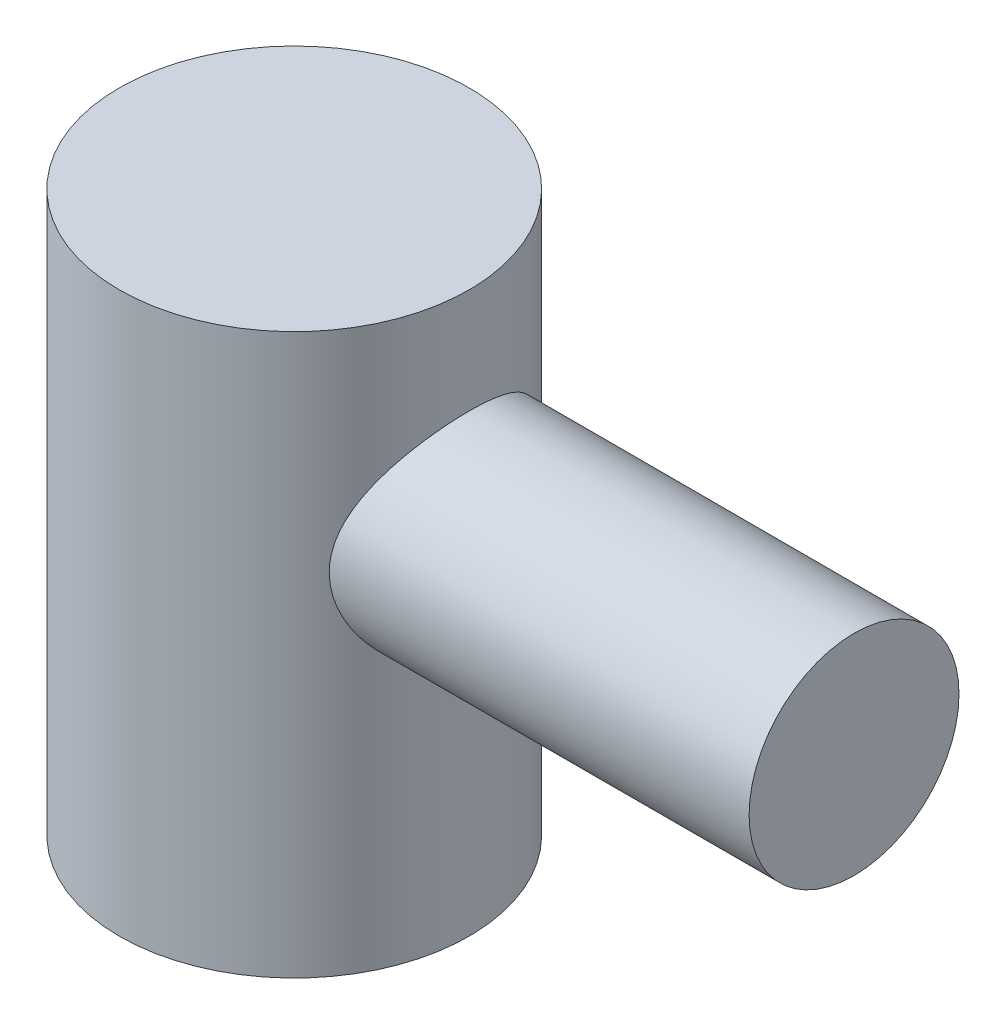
ISO-10303-21;
HEADER;
FILE_DESCRIPTION(('STEP AP214'),'2;1');
FILE_NAME('part.step','',(''),(''),'','','');
FILE_SCHEMA(('AUTOMOTIVE_DESIGN { 1 0 10303 214 1 1 1 1 }'));
ENDSEC;
DATA;
#1=APPLICATION_CONTEXT('core data for automotive mechanical design processes');
#2=APPLICATION_PROTOCOL_DEFINITION('international standard','automotive_design',2000,#1);
#3=PRODUCT_CONTEXT('',#1,'mechanical');
#4=PRODUCT('Part','Part','',(#3));
#5=PRODUCT_RELATED_PRODUCT_CATEGORY('part','',(#4));
#6=PRODUCT_DEFINITION_FORMATION('','',#4);
#7=PRODUCT_DEFINITION_CONTEXT('part definition',#1,'design');
#8=PRODUCT_DEFINITION('design','',#6,#7);
#9=PRODUCT_DEFINITION_SHAPE('','',#8);
#10=(LENGTH_UNIT() NAMED_UNIT(*) SI_UNIT(.MILLI.,.METRE.));
#11=(NAMED_UNIT(*) PLANE_ANGLE_UNIT() SI_UNIT($,.RADIAN.));
#12=(NAMED_UNIT(*) SI_UNIT($,.STERADIAN.) SOLID_ANGLE_UNIT());
#13=UNCERTAINTY_MEASURE_WITH_UNIT(LENGTH_MEASURE(1.E-05),#10,'distance_accuracy_value','');
#14=(GEOMETRIC_REPRESENTATION_CONTEXT(3) GLOBAL_UNCERTAINTY_ASSIGNED_CONTEXT((#13)) GLOBAL_UNIT_ASSIGNED_CONTEXT((#10,
#11,#12)) REPRESENTATION_CONTEXT('',''));
#15=CARTESIAN_POINT('',(0.,0.,0.));
#16=DIRECTION('',(0.,0.,1.));
#17=DIRECTION('',(1.,0.,0.));
#18=AXIS2_PLACEMENT_3D('',#15,#16,#17);
#19=CARTESIAN_POINT('',(0.,80.,0.));
#20=DIRECTION('',(0.,-1.,0.));
#21=DIRECTION('',(0.,0.,-1.));
#22=AXIS2_PLACEMENT_3D('',#19,#20,#21);
#23=CYLINDRICAL_SURFACE('',#22,25.);
#24=CARTESIAN_POINT('',(0.,80.,0.));
#25=DIRECTION('',(0.,1.,0.));
#26=DIRECTION('',(0.,0.,1.));
#27=AXIS2_PLACEMENT_3D('',#24,#25,#26);
#28=CIRCLE('',#27,25.);
#29=CARTESIAN_POINT('',(0.,80.,25.));
#30=VERTEX_POINT('',#29);
#31=EDGE_CURVE('E48',#30,#30,#28,.T.);
#32=ORIENTED_EDGE('',*,*,#31,.F.);
#33=EDGE_LOOP('',(#32));
#34=FACE_BOUND('',#33,.T.);
#35=CARTESIAN_POINT('',(0.,0.,0.));
#36=DIRECTION('',(0.,1.,0.));
#37=DIRECTION('',(0.,0.,1.));
#38=AXIS2_PLACEMENT_3D('',#35,#36,#37);
#39=CIRCLE('',#38,25.);
#40=CARTESIAN_POINT('',(0.,0.,25.));
#41=VERTEX_POINT('',#40);
#42=EDGE_CURVE('E52',#41,#41,#39,.T.);
#43=ORIENTED_EDGE('',*,*,#42,.T.);
#44=EDGE_LOOP('',(#43));
#45=FACE_BOUND('',#44,.T.);
#46=CARTESIAN_POINT('',(20.,50.,15.));
#47=CARTESIAN_POINT('',(19.9999964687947,49.6226145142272,15.0000023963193));
#48=CARTESIAN_POINT('',(20.0107202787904,49.2452556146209,14.9857375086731));
#49=CARTESIAN_POINT('',(20.053122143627,48.4938884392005,14.9289500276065));
#50=CARTESIAN_POINT('',(20.0847988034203,48.1198799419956,14.8864293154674));
#51=CARTESIAN_POINT('',(20.1677750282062,47.377931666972,14.7738184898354));
#52=CARTESIAN_POINT('',(20.2190925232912,47.0099977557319,14.7037031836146));
#53=CARTESIAN_POINT('',(20.3392862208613,46.2831336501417,14.536986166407));
#54=CARTESIAN_POINT('',(20.4081633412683,45.9242039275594,14.4403830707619));
#55=CARTESIAN_POINT('',(20.5604002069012,45.220108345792,14.222777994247));
#56=CARTESIAN_POINT('',(20.6436469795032,44.8748591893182,14.101965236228));
#57=CARTESIAN_POINT('',(20.822369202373,44.1967146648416,13.8367087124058));
#58=CARTESIAN_POINT('',(20.9178492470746,43.8638239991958,13.6922560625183));
#59=CARTESIAN_POINT('',(21.1183445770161,43.2117189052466,13.3809485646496));
#60=CARTESIAN_POINT('',(21.2233595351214,42.8925040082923,13.2140944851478));
#61=CARTESIAN_POINT('',(21.4403385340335,42.2686573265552,12.85905007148));
#62=CARTESIAN_POINT('',(21.5523028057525,41.9640260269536,12.6708590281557));
#63=CARTESIAN_POINT('',(21.7947080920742,41.3337440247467,12.2497635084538));
#64=CARTESIAN_POINT('',(21.9257326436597,41.0100880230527,12.014205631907));
#65=CARTESIAN_POINT('',(22.1901048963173,40.3832701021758,11.5185986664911));
#66=CARTESIAN_POINT('',(22.3234520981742,40.0801038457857,11.2585547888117));
#67=CARTESIAN_POINT('',(22.5895199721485,39.4950323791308,10.7147230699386));
#68=CARTESIAN_POINT('',(22.7222400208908,39.2131453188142,10.4309153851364));
#69=CARTESIAN_POINT('',(22.9839938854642,38.6721578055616,9.84074419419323));
#70=CARTESIAN_POINT('',(23.1130275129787,38.4130585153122,9.53437953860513));
#71=CARTESIAN_POINT('',(23.3782010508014,37.8923246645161,8.86581121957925));
#72=CARTESIAN_POINT('',(23.5135986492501,37.6334506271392,8.50115275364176));
#73=CARTESIAN_POINT('',(23.7726907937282,37.1476443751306,7.74713425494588));
#74=CARTESIAN_POINT('',(23.8963842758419,36.9207150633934,7.35777198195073));
#75=CARTESIAN_POINT('',(24.1284401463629,36.501403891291,6.55683327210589));
#76=CARTESIAN_POINT('',(24.2368132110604,36.3089979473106,6.14527258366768));
#77=CARTESIAN_POINT('',(24.4350209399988,35.9611005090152,5.30254644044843));
#78=CARTESIAN_POINT('',(24.5248586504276,35.8056029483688,4.87138422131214));
#79=CARTESIAN_POINT('',(24.6755383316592,35.5468984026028,4.03494720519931));
#80=CARTESIAN_POINT('',(24.7383290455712,35.4401177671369,3.63112766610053));
#81=CARTESIAN_POINT('',(24.8445947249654,35.2602861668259,2.81353449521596));
#82=CARTESIAN_POINT('',(24.8880708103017,35.1872332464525,2.39976144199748));
#83=CARTESIAN_POINT('',(24.9543898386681,35.0760742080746,1.56623358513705));
#84=CARTESIAN_POINT('',(24.9772489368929,35.0379407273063,1.14648372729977));
#85=CARTESIAN_POINT('',(25.0016884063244,34.9971768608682,0.304661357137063));
#86=CARTESIAN_POINT('',(25.0032709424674,34.9945428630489,-0.117410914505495));
#87=CARTESIAN_POINT('',(24.9862516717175,35.0229224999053,-0.907447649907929));
#88=CARTESIAN_POINT('',(24.9701316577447,35.0497988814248,-1.27562333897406));
#89=CARTESIAN_POINT('',(24.9219346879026,35.130437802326,-2.00792897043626));
#90=CARTESIAN_POINT('',(24.8898593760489,35.1841975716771,-2.37205932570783));
#91=CARTESIAN_POINT('',(24.8104885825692,35.3179281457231,-3.09378121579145));
#92=CARTESIAN_POINT('',(24.7631925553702,35.3978998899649,-3.45137251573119));
#93=CARTESIAN_POINT('',(24.6544299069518,35.583116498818,-4.15773979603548));
#94=CARTESIAN_POINT('',(24.5929627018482,35.6883624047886,-4.50651541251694));
#95=CARTESIAN_POINT('',(24.4567738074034,35.9236709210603,-5.19520363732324));
#96=CARTESIAN_POINT('',(24.3819785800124,36.0538715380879,-5.53505441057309));
#97=CARTESIAN_POINT('',(24.2208949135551,36.3374466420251,-6.20209550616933));
#98=CARTESIAN_POINT('',(24.1346065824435,36.4908209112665,-6.5292859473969));
#99=CARTESIAN_POINT('',(23.9521856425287,36.8194884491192,-7.16963421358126));
#100=CARTESIAN_POINT('',(23.8560519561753,36.9947841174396,-7.48279049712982));
#101=CARTESIAN_POINT('',(23.6556991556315,37.36605650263,-8.09390704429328));
#102=CARTESIAN_POINT('',(23.5514790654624,37.5620357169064,-8.39186546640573));
#103=CARTESIAN_POINT('',(23.3239637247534,37.9980874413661,-9.00624424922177));
#104=CARTESIAN_POINT('',(23.1998768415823,38.2406306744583,-9.32061987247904));
#105=CARTESIAN_POINT('',(22.9465322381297,38.7486963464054,-9.92798862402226));
#106=CARTESIAN_POINT('',(22.8172741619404,39.0142203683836,-10.2209802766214));
#107=CARTESIAN_POINT('',(22.5561867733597,39.5673072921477,-10.7849484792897));
#108=CARTESIAN_POINT('',(22.424354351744,39.8548982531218,-11.0558960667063));
#109=CARTESIAN_POINT('',(22.1611888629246,40.4506694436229,-11.5743787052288));
#110=CARTESIAN_POINT('',(22.029855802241,40.75884994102,-11.8219134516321));
#111=CARTESIAN_POINT('',(21.7557011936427,41.4317103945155,-12.319875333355));
#112=CARTESIAN_POINT('',(21.613315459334,41.7987964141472,-12.5673035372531));
#113=CARTESIAN_POINT('',(21.3375080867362,42.5559728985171,-13.0300939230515));
#114=CARTESIAN_POINT('',(21.2040879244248,42.9460671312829,-13.245450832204));
#115=CARTESIAN_POINT('',(20.9512885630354,43.7469509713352,-13.6417995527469));
#116=CARTESIAN_POINT('',(20.8318884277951,44.1577083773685,-13.8228428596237));
#117=CARTESIAN_POINT('',(20.6119850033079,44.9981851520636,-14.1486668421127));
#118=CARTESIAN_POINT('',(20.5114742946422,45.4278969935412,-14.2934617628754));
#119=CARTESIAN_POINT('',(20.3562303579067,46.1947228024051,-14.5133461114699));
#120=CARTESIAN_POINT('',(20.2963249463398,46.5284071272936,-14.5968176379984));
#121=CARTESIAN_POINT('',(20.1918823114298,47.2030262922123,-14.740957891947));
#122=CARTESIAN_POINT('',(20.1473426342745,47.5439599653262,-14.801630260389));
#123=CARTESIAN_POINT('',(20.0752131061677,48.2306417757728,-14.8993126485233));
#124=CARTESIAN_POINT('',(20.0476064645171,48.5763847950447,-14.936346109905));
#125=CARTESIAN_POINT('',(20.0102954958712,49.2705918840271,-14.9862956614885));
#126=CARTESIAN_POINT('',(20.0005915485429,49.6190560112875,-14.9992112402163));
#127=CARTESIAN_POINT('',(19.9994602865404,50.3165464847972,-15.0007196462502));
#128=CARTESIAN_POINT('',(20.0080581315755,50.6655729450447,-14.9892789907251));
#129=CARTESIAN_POINT('',(20.043249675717,51.3610639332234,-14.9421884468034));
#130=CARTESIAN_POINT('',(20.0698434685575,51.7075284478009,-14.9065384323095));
#131=CARTESIAN_POINT('',(20.1400577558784,52.3956601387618,-14.8115342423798));
#132=CARTESIAN_POINT('',(20.1836896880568,52.7373239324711,-14.7521641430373));
#133=CARTESIAN_POINT('',(20.2864517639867,53.4134767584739,-14.6105273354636));
#134=CARTESIAN_POINT('',(20.3455823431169,53.747965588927,-14.5282599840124));
#135=CARTESIAN_POINT('',(20.4773433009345,54.4074778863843,-14.3419451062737));
#136=CARTESIAN_POINT('',(20.5499523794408,54.7325153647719,-14.2379319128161));
#137=CARTESIAN_POINT('',(20.7066737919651,55.3723944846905,-14.0090289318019));
#138=CARTESIAN_POINT('',(20.7907898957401,55.6872327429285,-13.8841322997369));
#139=CARTESIAN_POINT('',(20.968365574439,56.3055594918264,-13.6144664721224));
#140=CARTESIAN_POINT('',(21.0618258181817,56.6090471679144,-13.4696958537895));
#141=CARTESIAN_POINT('',(21.255964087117,57.2038215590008,-13.1612008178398));
#142=CARTESIAN_POINT('',(21.3566425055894,57.4951076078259,-12.9974753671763));
#143=CARTESIAN_POINT('',(21.5818193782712,58.1162283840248,-12.6206784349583));
#144=CARTESIAN_POINT('',(21.7073372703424,58.4435312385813,-12.4040341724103));
#145=CARTESIAN_POINT('',(21.9623595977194,59.0790948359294,-11.9466860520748));
#146=CARTESIAN_POINT('',(22.0918633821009,59.3873586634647,-11.7059861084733));
#147=CARTESIAN_POINT('',(22.3520163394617,59.9842299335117,-11.2012519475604));
#148=CARTESIAN_POINT('',(22.482666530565,60.2728173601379,-10.9371945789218));
#149=CARTESIAN_POINT('',(22.7421398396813,60.828915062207,-10.3868971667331));
#150=CARTESIAN_POINT('',(22.8709628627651,61.0964242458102,-10.1006559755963));
#151=CARTESIAN_POINT('',(23.140558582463,61.642550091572,-9.46823898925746));
#152=CARTESIAN_POINT('',(23.2807021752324,61.9180750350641,-9.11911285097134));
#153=CARTESIAN_POINT('',(23.5514198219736,62.4386006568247,-8.39523410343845));
#154=CARTESIAN_POINT('',(23.6819928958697,62.683598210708,-8.0204788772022));
#155=CARTESIAN_POINT('',(23.9298839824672,63.140631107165,-7.24743454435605));
#156=CARTESIAN_POINT('',(24.0472083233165,63.3526822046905,-6.8491568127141));
#157=CARTESIAN_POINT('',(24.2652355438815,63.741454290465,-6.03136210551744));
#158=CARTESIAN_POINT('',(24.3659406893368,63.9181800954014,-5.61184803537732));
#159=CARTESIAN_POINT('',(24.541007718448,64.2223545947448,-4.78581544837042));
#160=CARTESIAN_POINT('',(24.6167514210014,64.3524495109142,-4.38056498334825));
#161=CARTESIAN_POINT('',(24.7490955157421,64.5782753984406,-3.55751767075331));
#162=CARTESIAN_POINT('',(24.8056966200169,64.6740076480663,-3.13972129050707));
#163=CARTESIAN_POINT('',(24.8979971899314,64.82950364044,-2.29560959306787));
#164=CARTESIAN_POINT('',(24.9337163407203,64.8893012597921,-1.86930269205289));
#165=CARTESIAN_POINT('',(24.9832025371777,64.972024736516,-1.01187931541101));
#166=CARTESIAN_POINT('',(24.9969724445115,64.9949554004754,-0.58076347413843));
#167=CARTESIAN_POINT('',(25.0017898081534,65.0029818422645,0.224319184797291));
#168=CARTESIAN_POINT('',(24.995624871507,64.9927191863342,0.598233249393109));
#169=CARTESIAN_POINT('',(24.9666545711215,64.944370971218,1.34357850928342));
#170=CARTESIAN_POINT('',(24.943851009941,64.9062884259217,1.71500996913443));
#171=CARTESIAN_POINT('',(24.8821504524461,64.8028081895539,2.45267263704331));
#172=CARTESIAN_POINT('',(24.8432535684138,64.737410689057,2.81890388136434));
#173=CARTESIAN_POINT('',(24.7502718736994,64.5801227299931,3.54366118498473));
#174=CARTESIAN_POINT('',(24.6961866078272,64.488231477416,3.90218701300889));
#175=CARTESIAN_POINT('',(24.5750236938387,64.2807130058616,4.60356798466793));
#176=CARTESIAN_POINT('',(24.5081696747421,64.1654925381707,4.94658261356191));
#177=CARTESIAN_POINT('',(24.362307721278,63.9116077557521,5.62112475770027));
#178=CARTESIAN_POINT('',(24.2833000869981,63.7729440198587,5.95265255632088));
#179=CARTESIAN_POINT('',(24.1146607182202,63.4733880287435,6.60272039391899));
#180=CARTESIAN_POINT('',(24.0250280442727,63.312493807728,6.92125928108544));
#181=CARTESIAN_POINT('',(23.836793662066,62.9697050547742,7.54407939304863));
#182=CARTESIAN_POINT('',(23.7381910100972,62.7878083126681,7.84835911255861));
#183=CARTESIAN_POINT('',(23.5226592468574,62.383371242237,8.47380952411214));
#184=CARTESIAN_POINT('',(23.4049025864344,62.1585623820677,8.79322928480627));
#185=CARTESIAN_POINT('',(23.1629684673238,61.6860725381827,9.41208272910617));
#186=CARTESIAN_POINT('',(23.0387906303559,61.4383902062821,9.71151523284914));
#187=CARTESIAN_POINT('',(22.7864386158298,60.9212080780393,10.2896938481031));
#188=CARTESIAN_POINT('',(22.6582605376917,60.6516865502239,10.5684188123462));
#189=CARTESIAN_POINT('',(22.4006932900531,60.0922118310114,11.1039294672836));
#190=CARTESIAN_POINT('',(22.271304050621,59.802257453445,11.3607138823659));
#191=CARTESIAN_POINT('',(21.9977448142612,59.1648158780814,11.8826192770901));
#192=CARTESIAN_POINT('',(21.8537838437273,58.8146980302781,12.1446596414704));
#193=CARTESIAN_POINT('',(21.6425770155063,58.2721741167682,12.5147542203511));
#194=CARTESIAN_POINT('',(21.5729581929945,58.0884254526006,12.6343004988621));
#195=CARTESIAN_POINT('',(21.4358222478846,57.7152195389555,12.8655976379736));
#196=CARTESIAN_POINT('',(21.368305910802,57.5257602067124,12.9773456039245));
#197=CARTESIAN_POINT('',(21.1698771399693,56.9493734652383,13.3003806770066));
#198=CARTESIAN_POINT('',(21.0429864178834,56.5541877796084,13.4996294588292));
#199=CARTESIAN_POINT('',(20.804863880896,55.7438842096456,13.8638028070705));
#200=CARTESIAN_POINT('',(20.6936280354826,55.3287714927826,14.0287362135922));
#201=CARTESIAN_POINT('',(20.5002998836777,54.5170874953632,14.309586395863));
#202=CARTESIAN_POINT('',(20.4165318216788,54.1219507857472,14.4284825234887));
#203=CARTESIAN_POINT('',(20.2697792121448,53.3195480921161,14.6339346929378));
#204=CARTESIAN_POINT('',(20.2067929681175,52.9122831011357,14.720493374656));
#205=CARTESIAN_POINT('',(20.1047510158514,52.0897743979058,14.8595576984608));
#206=CARTESIAN_POINT('',(20.0656508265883,51.6745470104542,14.9121266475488));
#207=CARTESIAN_POINT('',(20.0132789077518,50.8395350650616,14.9823442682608));
#208=CARTESIAN_POINT('',(20.0000039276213,50.4197510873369,14.999997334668));
#209=CARTESIAN_POINT('',(20.,50.,15.));
#210=B_SPLINE_CURVE_WITH_KNOTS('',3,(#46,#47,#48,#49,#50,#51,#52,#53,#54,#55,#56,#57,#58,#59,
#60,#61,#62,#63,#64,#65,#66,#67,#68,#69,#70,#71,#72,#73,#74,#75,#76,#77,#78,#79,#80,#81,#82,#83,
#84,#85,#86,#87,#88,#89,#90,#91,#92,#93,#94,#95,#96,#97,#98,#99,#100,#101,#102,#103,#104,#105,
#106,#107,#108,#109,#110,#111,#112,#113,#114,#115,#116,#117,#118,#119,#120,#121,#122,#123,#124,
#125,#126,#127,#128,#129,#130,#131,#132,#133,#134,#135,#136,#137,#138,#139,#140,#141,#142,#143,
#144,#145,#146,#147,#148,#149,#150,#151,#152,#153,#154,#155,#156,#157,#158,#159,#160,#161,#162,
#163,#164,#165,#166,#167,#168,#169,#170,#171,#172,#173,#174,#175,#176,#177,#178,#179,#180,#181,
#182,#183,#184,#185,#186,#187,#188,#189,#190,#191,#192,#193,#194,#195,#196,#197,#198,#199,#200,
#201,#202,#203,#204,#205,#206,#207,#208,#209),.UNSPECIFIED.,.T.,.F.,(4,2,2,2,2,2,2,2,2,2,2,2,2,
2,2,2,2,2,2,2,2,2,2,2,2,2,2,2,2,2,2,2,2,2,2,2,2,2,2,2,2,2,2,2,2,2,2,2,2,2,2,2,2,2,2,2,2,2,2,2,2,
2,2,2,2,2,2,2,2,2,2,2,2,2,2,2,2,2,2,2,2,4),(0.,1.1316953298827,2.26331531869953,
3.39597083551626,4.52868557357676,5.65287001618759,6.77747791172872,7.9020472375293,
9.02665395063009,10.2889873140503,11.5510526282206,12.8141825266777,14.0773768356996,
15.4772842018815,16.8773186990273,18.2763726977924,19.6751965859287,20.9405517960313,
22.2058336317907,23.4701231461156,24.7342840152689,25.8414802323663,26.9485623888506,
28.0556842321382,29.1628516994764,30.2763286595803,31.3897951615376,32.5033836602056,
33.6171067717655,34.8638356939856,36.1106505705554,37.3590779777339,38.6075216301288,
40.0008676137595,41.3944424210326,42.7859089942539,44.1768278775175,45.2232041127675,
46.2694131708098,47.3145831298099,48.3597752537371,49.4064051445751,50.4530404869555,
51.5003796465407,52.547748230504,53.5934755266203,54.6395462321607,55.6856918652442,
56.7318945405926,57.9669326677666,59.2017701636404,60.4378456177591,61.6739850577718,
63.0711349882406,64.4684277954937,65.8650503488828,67.2614823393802,68.55652255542,
69.8515145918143,71.1452838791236,72.4388844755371,73.5598185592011,74.6806312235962,
75.8014360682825,76.9222745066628,78.0250345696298,79.1277674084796,80.2305978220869,
81.3335443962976,82.5561953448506,83.7789184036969,85.0028734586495,86.2268996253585,
87.6063272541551,88.296157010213,88.9862414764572,90.3654600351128,91.7443228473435,
93.0056806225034,94.266935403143,95.5258342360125,96.7845746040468),.UNSPECIFIED.);
#211=CARTESIAN_POINT('',(20.,50.,15.));
#212=VERTEX_POINT('',#211);
#213=EDGE_CURVE('E10',#212,#212,#210,.T.);
#214=ORIENTED_EDGE('',*,*,#213,.F.);
#215=EDGE_LOOP('',(#214));
#216=FACE_BOUND('',#215,.T.);
#217=ADVANCED_FACE('F38',(#34,#45,#216),#23,.T.);
#218=CARTESIAN_POINT('',(0.,80.,0.));
#219=DIRECTION('',(0.,1.,0.));
#220=DIRECTION('',(0.,0.,1.));
#221=AXIS2_PLACEMENT_3D('',#218,#219,#220);
#222=PLANE('',#221);
#223=ORIENTED_EDGE('',*,*,#31,.T.);
#224=EDGE_LOOP('',(#223));
#225=FACE_BOUND('',#224,.T.);
#226=ADVANCED_FACE('F72',(#225),#222,.T.);
#227=CARTESIAN_POINT('',(0.,0.,0.));
#228=DIRECTION('',(0.,1.,0.));
#229=DIRECTION('',(0.,0.,1.));
#230=AXIS2_PLACEMENT_3D('',#227,#228,#229);
#231=PLANE('',#230);
#232=ORIENTED_EDGE('',*,*,#42,.F.);
#233=EDGE_LOOP('',(#232));
#234=FACE_BOUND('',#233,.T.);
#235=ADVANCED_FACE('F66',(#234),#231,.F.);
#236=CARTESIAN_POINT('',(80.,50.,0.));
#237=DIRECTION('',(-1.,0.,0.));
#238=DIRECTION('',(0.,0.,1.));
#239=AXIS2_PLACEMENT_3D('',#236,#237,#238);
#240=CYLINDRICAL_SURFACE('',#239,15.);
#241=CARTESIAN_POINT('',(80.,50.,0.));
#242=DIRECTION('',(1.,0.,0.));
#243=DIRECTION('',(0.,0.,-1.));
#244=AXIS2_PLACEMENT_3D('',#241,#242,#243);
#245=CIRCLE('',#244,15.);
#246=CARTESIAN_POINT('',(80.,50.,-15.));
#247=VERTEX_POINT('',#246);
#248=EDGE_CURVE('E57',#247,#247,#245,.T.);
#249=ORIENTED_EDGE('',*,*,#248,.F.);
#250=EDGE_LOOP('',(#249));
#251=FACE_BOUND('',#250,.T.);
#252=ORIENTED_EDGE('',*,*,#213,.T.);
#253=EDGE_LOOP('',(#252));
#254=FACE_BOUND('',#253,.T.);
#255=ADVANCED_FACE('F64',(#251,#254),#240,.T.);
#256=CARTESIAN_POINT('',(80.,50.,0.));
#257=DIRECTION('',(1.,0.,0.));
#258=DIRECTION('',(0.,0.,-1.));
#259=AXIS2_PLACEMENT_3D('',#256,#257,#258);
#260=PLANE('',#259);
#261=ORIENTED_EDGE('',*,*,#248,.T.);
#262=EDGE_LOOP('',(#261));
#263=FACE_BOUND('',#262,.T.);
#264=ADVANCED_FACE('F62',(#263),#260,.T.);
#265=CLOSED_SHELL('',(#217,#226,#235,#255,#264));
#266=MANIFOLD_SOLID_BREP('B2',#265);
#267=ADVANCED_BREP_SHAPE_REPRESENTATION('',(#18,#266),#14);
#268=SHAPE_DEFINITION_REPRESENTATION(#9,#267);
ENDSEC;
END-ISO-10303-21;
